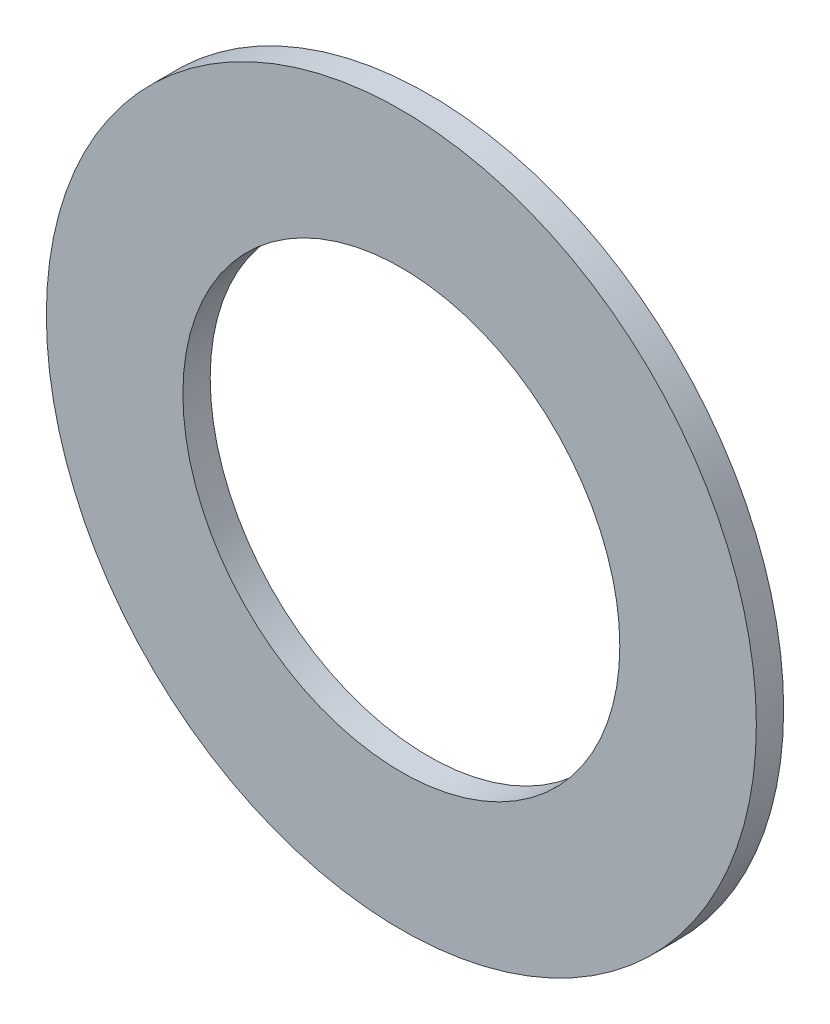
from build123d import *

# Parameters (mm, degrees)
ESQUISSE1_R          = 6.5
ESQUISSE1_R_2        = 4
BASE_EXTRUSION_DEPTH = 0.5


with BuildPart() as part:
    # Esquisse1 → Base-Extrusion (new body)
    with BuildSketch(Plane.XY):
        Circle(ESQUISSE1_R)
        Circle(ESQUISSE1_R_2, mode=Mode.SUBTRACT)
    extrude(amount=BASE_EXTRUSION_DEPTH)


solid = part.part
